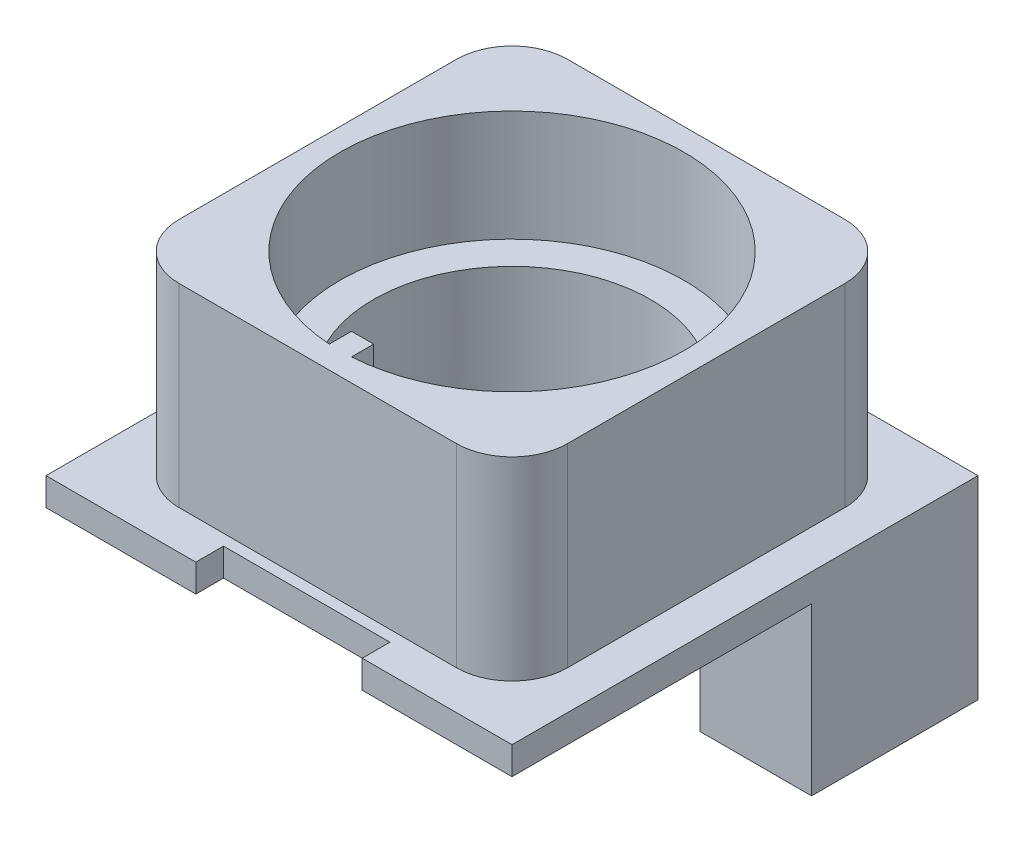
from build123d import *
from build123d.topology import SkipClean

# Parameters (mm, degrees)
SKETCH1_W           = 16.8
SKETCH1_H           = 16.8
BOSS_EXTRUDE1_DEPTH = 1
SKETCH2_W           = 14
SKETCH2_H           = 14
BOSS_EXTRUDE2_DEPTH = 7
SKETCH3_R           = 6.2
CUT_EXTRUDE1_DEPTH  = 4
SKETCH4_R           = 5
CUT_EXTRUDE2_DEPTH  = 13.534751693
FILLET2_R           = 2
BOSS_EXTRUDE3_START = 4
BOSS_EXTRUDE3_DEPTH = 4
SKETCH7_W           = 6
SKETCH7_H           = 1
CUT_EXTRUDE3_DEPTH  = 14.788400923
BOSS_EXTRUDE4_DEPTH = 7


with BuildPart() as part:
    # Sketch1 → Boss-Extrude1 (new body)
    with BuildSketch(Plane(origin=(0, 0, 0), x_dir=(1, 0, 0), z_dir=(0, 1, 0))):
        Rectangle(SKETCH1_W, SKETCH1_H)
    extrude(amount=BOSS_EXTRUDE1_DEPTH)

    # Sketch2 → Boss-Extrude2 (add)
    with BuildSketch(Plane(origin=(0, 1, 0), x_dir=(1, 0, 0), z_dir=(0, 1, 0))):
        Rectangle(SKETCH2_W, SKETCH2_H)
    extrude(amount=BOSS_EXTRUDE2_DEPTH)

    # Sketch3 → Cut-Extrude1 (cut)
    with BuildSketch(Plane(origin=(0, 8, 0), x_dir=(1, 0, 0), z_dir=(0, 1, 0))):
        with Locations(Location((0, 0, 0), (0, 0, 270))):
            Circle(SKETCH3_R)
    extrude(amount=-CUT_EXTRUDE1_DEPTH, mode=Mode.SUBTRACT)

    # Sketch4 → Cut-Extrude2 (cut, through all)
    with BuildSketch(Plane(origin=(0, 4, 0), x_dir=(1, 0, 0), z_dir=(0, 1, 0))):
        with Locations(Location((0, 0, 0), (0, 0, 270))):
            Circle(SKETCH4_R)
    extrude(amount=-CUT_EXTRUDE2_DEPTH, mode=Mode.SUBTRACT)

    # Fillet2
    fillet2_edges = [part.edges().sort_by_distance(p)[0] for p in [
        (7, 4.5, 7),
        (7, 4.5, -7),
        (-7, 4.5, -7),
        (-7, 4.5, 7),
    ]]
    fillet(fillet2_edges, radius=FILLET2_R)

    # Sketch6 → Boss-Extrude3 (add)
    with BuildSketch(Plane(origin=(0, 4, 0), x_dir=(1, 0, 0), z_dir=(0, 1, 0)).offset(BOSS_EXTRUDE3_START)):
        with BuildLine():
            Line((-0.4, -6.187083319), (-0.4, -5.387083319))
            Line((-0.4, -5.387083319), (0.4, -5.387083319))
            Line((0.4, -5.387083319), (0.4, -6.187083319))
            ThreePointArc((0.4, -6.187083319), (0, -6.2), (-0.4, -6.187083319))
        make_face()
    extrude(amount=-BOSS_EXTRUDE3_DEPTH)

    # Sketch7 → Cut-Extrude3 (cut, through all)
    with BuildSketch(Plane(origin=(0, 1, 0), x_dir=(1, 0, 0), z_dir=(0, 1, 0))):
        with Locations((0, 7.9)):
            Rectangle(SKETCH7_W, SKETCH7_H)
        with Locations((0, -7.9)):
            Rectangle(SKETCH7_W, SKETCH7_H)
    extrude(amount=-CUT_EXTRUDE3_DEPTH, mode=Mode.SUBTRACT)

    # Sketch8 → Boss-Extrude4 (add)
    with SkipClean():  # the faces are left unmerged after this step: merging them gives an invalid solid
        with BuildSketch(Plane(origin=(0, 1, 0), x_dir=(1, 0, 0), z_dir=(0, 1, 0))):
            with BuildLine():
                Line((8.4, 2.4), (8.4, 8.4))
                Line((8.4, 8.4), (3, 8.4))
                Line((3, 8.4), (3, 7.4))
                Line((3, 7.4), (2.4, 7.4))
                Line((2.4, 7.4), (2.4, 7))
                Line((2.4, 7), (5, 7))
                ThreePointArc((5, 7), (6.414213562, 6.414213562), (7, 5))
                Line((7, 5), (7, 2.4))
                Line((7, 2.4), (8.4, 2.4))
            make_face()
            with BuildLine():
                Line((4.38634244, 2.4), (7, 2.4))
                Line((7, 2.4), (7, 5))
                ThreePointArc((7, 5), (6.414213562, 6.414213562), (5, 7))
                Line((5, 7), (2.4, 7))
                Line((2.4, 7), (2.4, 4.38634244))
                ThreePointArc((2.4, 4.38634244), (3.535533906, 3.535533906), (4.38634244, 2.4))
            make_face()
        extrude(amount=-BOSS_EXTRUDE4_DEPTH)


solid = part.part
